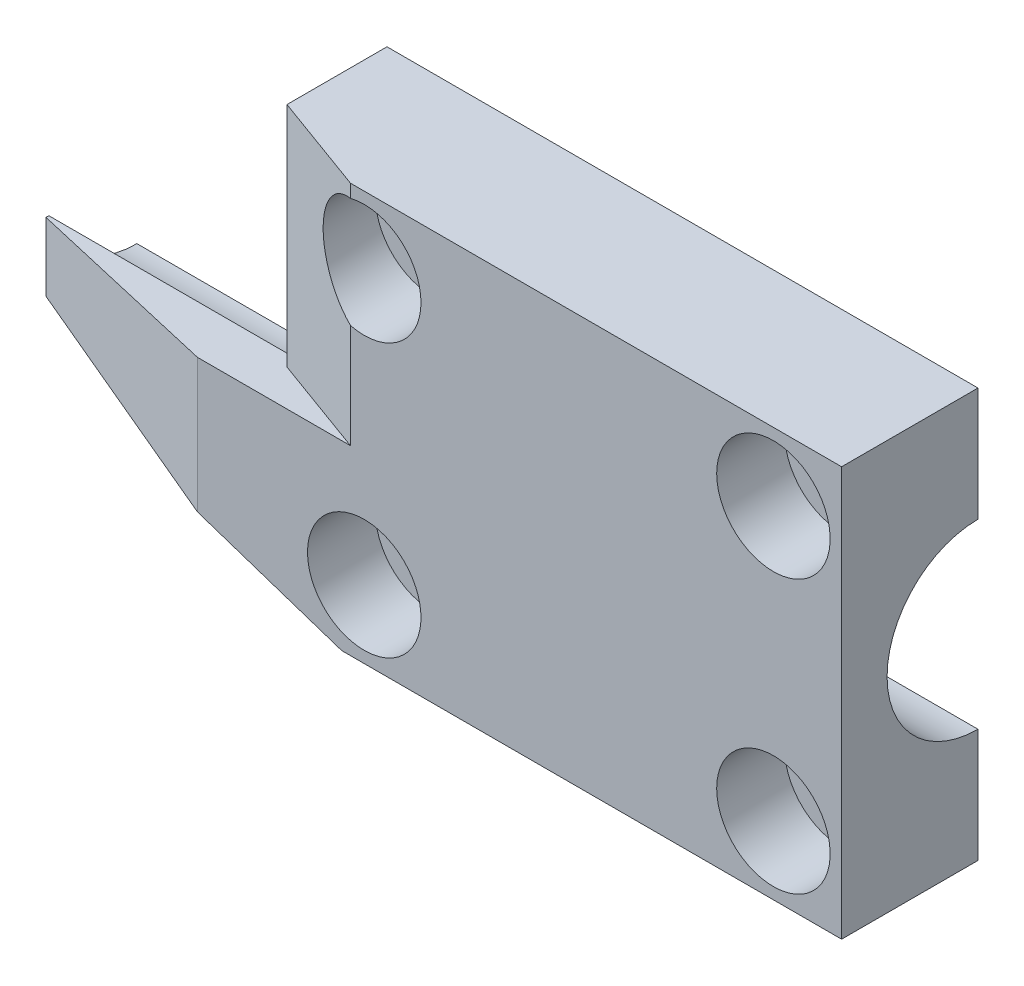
ISO-10303-21;
HEADER;
FILE_DESCRIPTION(('STEP AP214'),'2;1');
FILE_NAME('part.step','',(''),(''),'','','');
FILE_SCHEMA(('AUTOMOTIVE_DESIGN { 1 0 10303 214 1 1 1 1 }'));
ENDSEC;
DATA;
#1=APPLICATION_CONTEXT('core data for automotive mechanical design processes');
#2=APPLICATION_PROTOCOL_DEFINITION('international standard','automotive_design',2000,#1);
#3=PRODUCT_CONTEXT('',#1,'mechanical');
#4=PRODUCT('Part','Part','',(#3));
#5=PRODUCT_RELATED_PRODUCT_CATEGORY('part','',(#4));
#6=PRODUCT_DEFINITION_FORMATION('','',#4);
#7=PRODUCT_DEFINITION_CONTEXT('part definition',#1,'design');
#8=PRODUCT_DEFINITION('design','',#6,#7);
#9=PRODUCT_DEFINITION_SHAPE('','',#8);
#10=(LENGTH_UNIT() NAMED_UNIT(*) SI_UNIT(.MILLI.,.METRE.));
#11=(NAMED_UNIT(*) PLANE_ANGLE_UNIT() SI_UNIT($,.RADIAN.));
#12=(NAMED_UNIT(*) SI_UNIT($,.STERADIAN.) SOLID_ANGLE_UNIT());
#13=UNCERTAINTY_MEASURE_WITH_UNIT(LENGTH_MEASURE(1.E-05),#10,'distance_accuracy_value','');
#14=(GEOMETRIC_REPRESENTATION_CONTEXT(3) GLOBAL_UNCERTAINTY_ASSIGNED_CONTEXT((#13)) GLOBAL_UNIT_ASSIGNED_CONTEXT((#10,
#11,#12)) REPRESENTATION_CONTEXT('',''));
#15=CARTESIAN_POINT('',(0.,0.,0.));
#16=DIRECTION('',(0.,0.,1.));
#17=DIRECTION('',(1.,0.,0.));
#18=AXIS2_PLACEMENT_3D('',#15,#16,#17);
#19=CARTESIAN_POINT('',(0.,0.,9.525));
#20=DIRECTION('',(0.,0.,-1.));
#21=DIRECTION('',(-1.,0.,0.));
#22=AXIS2_PLACEMENT_3D('',#19,#20,#21);
#23=PLANE('',#22);
#24=CARTESIAN_POINT('',(14.2875,9.525,9.525));
#25=DIRECTION('',(0.,0.,-1.));
#26=DIRECTION('',(-1.,0.,0.));
#27=AXIS2_PLACEMENT_3D('',#24,#25,#26);
#28=CIRCLE('',#27,3.9624);
#29=CARTESIAN_POINT('',(10.3251,9.525,9.525));
#30=VERTEX_POINT('',#29);
#31=EDGE_CURVE('E199',#30,#30,#28,.F.);
#32=ORIENTED_EDGE('',*,*,#31,.F.);
#33=EDGE_LOOP('',(#32));
#34=FACE_BOUND('',#33,.T.);
#35=CARTESIAN_POINT('',(-14.2875,-9.525,9.525));
#36=DIRECTION('',(0.,0.,-1.));
#37=DIRECTION('',(-1.,0.,0.));
#38=AXIS2_PLACEMENT_3D('',#35,#36,#37);
#39=CIRCLE('',#38,3.9624);
#40=CARTESIAN_POINT('',(-18.2499,-9.525,9.525));
#41=VERTEX_POINT('',#40);
#42=EDGE_CURVE('E184',#41,#41,#39,.F.);
#43=ORIENTED_EDGE('',*,*,#42,.F.);
#44=EDGE_LOOP('',(#43));
#45=FACE_BOUND('',#44,.T.);
#46=DIRECTION('',(-1.,0.,0.));
#47=VECTOR('',#46,1.);
#48=CARTESIAN_POINT('',(-22.225,14.2875,9.525));
#49=LINE('',#48,#47);
#50=CARTESIAN_POINT('',(19.05,14.2875,9.525));
#51=VERTEX_POINT('',#50);
#52=CARTESIAN_POINT('',(-15.246407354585,14.2875,9.525));
#53=VERTEX_POINT('',#52);
#54=EDGE_CURVE('E151',#51,#53,#49,.T.);
#55=ORIENTED_EDGE('',*,*,#54,.T.);
#56=DIRECTION('',(0.,-1.,0.));
#57=VECTOR('',#56,1.);
#58=CARTESIAN_POINT('',(-15.246407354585,0.,9.525));
#59=LINE('',#58,#57);
#60=CARTESIAN_POINT('',(-15.246407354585,13.3696209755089,9.525));
#61=VERTEX_POINT('',#60);
#62=EDGE_CURVE('E219',#53,#61,#59,.T.);
#63=ORIENTED_EDGE('',*,*,#62,.T.);
#64=CARTESIAN_POINT('',(-14.2875,9.525,9.525));
#65=DIRECTION('',(0.,0.,-1.));
#66=DIRECTION('',(-1.,0.,0.));
#67=AXIS2_PLACEMENT_3D('',#64,#65,#66);
#68=CIRCLE('',#67,3.9624);
#69=CARTESIAN_POINT('',(-15.246407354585,5.68037902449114,9.525));
#70=VERTEX_POINT('',#69);
#71=EDGE_CURVE('E192',#70,#61,#68,.F.);
#72=ORIENTED_EDGE('',*,*,#71,.F.);
#73=DIRECTION('',(0.,-1.,0.));
#74=VECTOR('',#73,1.);
#75=CARTESIAN_POINT('',(-15.246407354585,0.,9.525));
#76=LINE('',#75,#74);
#77=CARTESIAN_POINT('',(-15.246407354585,-1.58750000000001,9.525));
#78=VERTEX_POINT('',#77);
#79=EDGE_CURVE('E216',#70,#78,#76,.T.);
#80=ORIENTED_EDGE('',*,*,#79,.T.);
#81=DIRECTION('',(-1.,0.,0.));
#82=VECTOR('',#81,1.);
#83=CARTESIAN_POINT('',(-39.6875,-1.58750000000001,9.525));
#84=LINE('',#83,#82);
#85=CARTESIAN_POINT('',(-25.935064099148,-1.58750000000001,9.52499999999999));
#86=VERTEX_POINT('',#85);
#87=EDGE_CURVE('E147',#78,#86,#84,.T.);
#88=ORIENTED_EDGE('',*,*,#87,.T.);
#89=DIRECTION('',(0.,-1.,0.));
#90=VECTOR('',#89,1.);
#91=CARTESIAN_POINT('',(-25.9350640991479,0.,9.525));
#92=LINE('',#91,#90);
#93=CARTESIAN_POINT('',(-25.9350640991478,-10.9370710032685,9.52500000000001));
#94=VERTEX_POINT('',#93);
#95=EDGE_CURVE('E130',#86,#94,#92,.T.);
#96=ORIENTED_EDGE('',*,*,#95,.T.);
#97=DIRECTION('',(0.948885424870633,-0.3156207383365,0.));
#98=VECTOR('',#97,1.);
#99=CARTESIAN_POINT('',(-5.85907965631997,-17.614797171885,9.525));
#100=LINE('',#99,#98);
#101=CARTESIAN_POINT('',(-15.8623,-14.2875,9.52500000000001));
#102=VERTEX_POINT('',#101);
#103=EDGE_CURVE('E120',#94,#102,#100,.T.);
#104=ORIENTED_EDGE('',*,*,#103,.T.);
#105=DIRECTION('',(1.,0.,0.));
#106=VECTOR('',#105,1.);
#107=CARTESIAN_POINT('',(19.05,-14.2875,9.525));
#108=LINE('',#107,#106);
#109=CARTESIAN_POINT('',(19.05,-14.2875,9.525));
#110=VERTEX_POINT('',#109);
#111=EDGE_CURVE('E126',#102,#110,#108,.T.);
#112=ORIENTED_EDGE('',*,*,#111,.T.);
#113=DIRECTION('',(0.,1.,0.));
#114=VECTOR('',#113,1.);
#115=CARTESIAN_POINT('',(19.05,14.2875,9.525));
#116=LINE('',#115,#114);
#117=EDGE_CURVE('E169',#110,#51,#116,.T.);
#118=ORIENTED_EDGE('',*,*,#117,.T.);
#119=EDGE_LOOP('',(#55,#63,#72,#80,#88,#96,#104,#112,#118));
#120=FACE_BOUND('',#119,.T.);
#121=CARTESIAN_POINT('',(14.2875,-9.525,9.525));
#122=DIRECTION('',(0.,0.,-1.));
#123=DIRECTION('',(-1.,0.,0.));
#124=AXIS2_PLACEMENT_3D('',#121,#122,#123);
#125=CIRCLE('',#124,3.96239999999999);
#126=CARTESIAN_POINT('',(10.3251,-9.525,9.525));
#127=VERTEX_POINT('',#126);
#128=EDGE_CURVE('E206',#127,#127,#125,.F.);
#129=ORIENTED_EDGE('',*,*,#128,.F.);
#130=EDGE_LOOP('',(#129));
#131=FACE_BOUND('',#130,.T.);
#132=ADVANCED_FACE('F33',(#34,#45,#120,#131),#23,.F.);
#133=CARTESIAN_POINT('',(14.2875,-9.525,9.525));
#134=DIRECTION('',(0.,0.,-1.));
#135=DIRECTION('',(-1.,0.,0.));
#136=AXIS2_PLACEMENT_3D('',#133,#134,#135);
#137=CYLINDRICAL_SURFACE('',#136,2.3876);
#138=CARTESIAN_POINT('',(14.2875,-9.525,0.));
#139=DIRECTION('',(0.,0.,1.));
#140=DIRECTION('',(1.,0.,0.));
#141=AXIS2_PLACEMENT_3D('',#138,#139,#140);
#142=CIRCLE('',#141,2.3876);
#143=CARTESIAN_POINT('',(11.8999,-9.525,0.));
#144=VERTEX_POINT('',#143);
#145=EDGE_CURVE('E273',#144,#144,#142,.T.);
#146=CARTESIAN_POINT('',(14.2875,-9.525,4.7752));
#147=DIRECTION('',(0.,0.,1.));
#148=DIRECTION('',(1.,0.,0.));
#149=AXIS2_PLACEMENT_3D('',#146,#147,#148);
#150=CIRCLE('',#149,2.3876);
#151=CARTESIAN_POINT('',(11.8999,-9.525,4.7752));
#152=VERTEX_POINT('',#151);
#153=EDGE_CURVE('E203',#152,#152,#150,.T.);
#154=CARTESIAN_POINT('',(11.8999,-9.525,0.));
#155=CARTESIAN_POINT('',(11.8999,-9.525,0.0497416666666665));
#156=CARTESIAN_POINT('',(11.8999,-9.525,0.0994833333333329));
#157=CARTESIAN_POINT('',(11.8999,-9.525,0.198966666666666));
#158=CARTESIAN_POINT('',(11.8999,-9.525,0.248708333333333));
#159=CARTESIAN_POINT('',(11.8999,-9.525,0.348191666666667));
#160=CARTESIAN_POINT('',(11.8999,-9.525,0.397933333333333));
#161=CARTESIAN_POINT('',(11.8999,-9.525,0.497416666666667));
#162=CARTESIAN_POINT('',(11.8999,-9.525,0.547158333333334));
#163=CARTESIAN_POINT('',(11.8999,-9.525,0.646641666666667));
#164=CARTESIAN_POINT('',(11.8999,-9.525,0.696383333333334));
#165=CARTESIAN_POINT('',(11.8999,-9.525,0.795866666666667));
#166=CARTESIAN_POINT('',(11.8999,-9.525,0.845608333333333));
#167=CARTESIAN_POINT('',(11.8999,-9.525,0.945091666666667));
#168=CARTESIAN_POINT('',(11.8999,-9.525,0.994833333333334));
#169=CARTESIAN_POINT('',(11.8999,-9.525,1.09431666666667));
#170=CARTESIAN_POINT('',(11.8999,-9.525,1.14405833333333));
#171=CARTESIAN_POINT('',(11.8999,-9.525,1.24354166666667));
#172=CARTESIAN_POINT('',(11.8999,-9.525,1.29328333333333));
#173=CARTESIAN_POINT('',(11.8999,-9.525,1.39276666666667));
#174=CARTESIAN_POINT('',(11.8999,-9.525,1.44250833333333));
#175=CARTESIAN_POINT('',(11.8999,-9.525,1.54199166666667));
#176=CARTESIAN_POINT('',(11.8999,-9.525,1.59173333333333));
#177=CARTESIAN_POINT('',(11.8999,-9.525,1.69121666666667));
#178=CARTESIAN_POINT('',(11.8999,-9.525,1.74095833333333));
#179=CARTESIAN_POINT('',(11.8999,-9.525,1.84044166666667));
#180=CARTESIAN_POINT('',(11.8999,-9.525,1.89018333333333));
#181=CARTESIAN_POINT('',(11.8999,-9.525,1.98966666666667));
#182=CARTESIAN_POINT('',(11.8999,-9.525,2.03940833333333));
#183=CARTESIAN_POINT('',(11.8999,-9.525,2.13889166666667));
#184=CARTESIAN_POINT('',(11.8999,-9.525,2.18863333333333));
#185=CARTESIAN_POINT('',(11.8999,-9.525,2.28811666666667));
#186=CARTESIAN_POINT('',(11.8999,-9.525,2.33785833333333));
#187=CARTESIAN_POINT('',(11.8999,-9.525,2.43734166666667));
#188=CARTESIAN_POINT('',(11.8999,-9.525,2.48708333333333));
#189=CARTESIAN_POINT('',(11.8999,-9.525,2.58656666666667));
#190=CARTESIAN_POINT('',(11.8999,-9.525,2.63630833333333));
#191=CARTESIAN_POINT('',(11.8999,-9.525,2.73579166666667));
#192=CARTESIAN_POINT('',(11.8999,-9.525,2.78553333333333));
#193=CARTESIAN_POINT('',(11.8999,-9.525,2.88501666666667));
#194=CARTESIAN_POINT('',(11.8999,-9.525,2.93475833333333));
#195=CARTESIAN_POINT('',(11.8999,-9.525,3.03424166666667));
#196=CARTESIAN_POINT('',(11.8999,-9.525,3.08398333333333));
#197=CARTESIAN_POINT('',(11.8999,-9.525,3.18346666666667));
#198=CARTESIAN_POINT('',(11.8999,-9.525,3.23320833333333));
#199=CARTESIAN_POINT('',(11.8999,-9.525,3.33269166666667));
#200=CARTESIAN_POINT('',(11.8999,-9.525,3.38243333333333));
#201=CARTESIAN_POINT('',(11.8999,-9.525,3.48191666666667));
#202=CARTESIAN_POINT('',(11.8999,-9.525,3.53165833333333));
#203=CARTESIAN_POINT('',(11.8999,-9.525,3.63114166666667));
#204=CARTESIAN_POINT('',(11.8999,-9.525,3.68088333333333));
#205=CARTESIAN_POINT('',(11.8999,-9.525,3.78036666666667));
#206=CARTESIAN_POINT('',(11.8999,-9.525,3.83010833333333));
#207=CARTESIAN_POINT('',(11.8999,-9.525,3.92959166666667));
#208=CARTESIAN_POINT('',(11.8999,-9.525,3.97933333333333));
#209=CARTESIAN_POINT('',(11.8999,-9.525,4.07881666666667));
#210=CARTESIAN_POINT('',(11.8999,-9.525,4.12855833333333));
#211=CARTESIAN_POINT('',(11.8999,-9.525,4.22804166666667));
#212=CARTESIAN_POINT('',(11.8999,-9.525,4.27778333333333));
#213=CARTESIAN_POINT('',(11.8999,-9.525,4.37726666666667));
#214=CARTESIAN_POINT('',(11.8999,-9.525,4.42700833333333));
#215=CARTESIAN_POINT('',(11.8999,-9.525,4.52649166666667));
#216=CARTESIAN_POINT('',(11.8999,-9.525,4.57623333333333));
#217=CARTESIAN_POINT('',(11.8999,-9.525,4.67571666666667));
#218=CARTESIAN_POINT('',(11.8999,-9.525,4.72545833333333));
#219=CARTESIAN_POINT('',(11.8999,-9.525,4.7752));
#220=B_SPLINE_CURVE_WITH_KNOTS('',3,(#154,#155,#156,#157,#158,#159,#160,#161,#162,#163,#164,
#165,#166,#167,#168,#169,#170,#171,#172,#173,#174,#175,#176,#177,#178,#179,#180,#181,#182,#183,
#184,#185,#186,#187,#188,#189,#190,#191,#192,#193,#194,#195,#196,#197,#198,#199,#200,#201,#202,
#203,#204,#205,#206,#207,#208,#209,#210,#211,#212,#213,#214,#215,#216,#217,#218,#219),
.UNSPECIFIED.,.F.,.F.,(4,2,2,2,2,2,2,2,2,2,2,2,2,2,2,2,2,2,2,2,2,2,2,2,2,2,2,2,2,2,2,2,4),(0.,
0.149224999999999,0.29845,0.447675,0.596900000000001,0.746125,0.89535,1.044575,1.1938,1.343025,
1.49225,1.641475,1.7907,1.939925,2.08915,2.238375,2.3876,2.536825,2.68605,2.835275,2.9845,
3.133725,3.28295,3.432175,3.5814,3.730625,3.87985,4.029075,4.1783,4.327525,4.47675,4.625975,
4.7752),.UNSPECIFIED.);
#221=EDGE_CURVE('BSEAM305',#144,#152,#220,.T.);
#222=ORIENTED_EDGE('',*,*,#145,.F.);
#223=ORIENTED_EDGE('',*,*,#153,.T.);
#224=ORIENTED_EDGE('',*,*,#221,.T.);
#225=ORIENTED_EDGE('',*,*,#221,.F.);
#226=EDGE_LOOP('',(#222,#224,#223,#225));
#227=FACE_BOUND('',#226,.T.);
#228=ADVANCED_FACE('F305',(#227),#137,.F.);
#229=CARTESIAN_POINT('',(14.2875,9.525,9.525));
#230=DIRECTION('',(0.,0.,-1.));
#231=DIRECTION('',(-1.,0.,0.));
#232=AXIS2_PLACEMENT_3D('',#229,#230,#231);
#233=CYLINDRICAL_SURFACE('',#232,2.3876);
#234=CARTESIAN_POINT('',(14.2875,9.525,0.));
#235=DIRECTION('',(0.,0.,1.));
#236=DIRECTION('',(1.,0.,0.));
#237=AXIS2_PLACEMENT_3D('',#234,#235,#236);
#238=CIRCLE('',#237,2.3876);
#239=CARTESIAN_POINT('',(11.8999,9.525,0.));
#240=VERTEX_POINT('',#239);
#241=EDGE_CURVE('E270',#240,#240,#238,.T.);
#242=CARTESIAN_POINT('',(14.2875,9.525,4.7752));
#243=DIRECTION('',(0.,0.,1.));
#244=DIRECTION('',(1.,0.,0.));
#245=AXIS2_PLACEMENT_3D('',#242,#243,#244);
#246=CIRCLE('',#245,2.3876);
#247=CARTESIAN_POINT('',(11.8999,9.525,4.7752));
#248=VERTEX_POINT('',#247);
#249=EDGE_CURVE('E196',#248,#248,#246,.T.);
#250=CARTESIAN_POINT('',(11.8999,9.525,0.));
#251=CARTESIAN_POINT('',(11.8999,9.525,0.0497416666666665));
#252=CARTESIAN_POINT('',(11.8999,9.525,0.0994833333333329));
#253=CARTESIAN_POINT('',(11.8999,9.525,0.198966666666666));
#254=CARTESIAN_POINT('',(11.8999,9.525,0.248708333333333));
#255=CARTESIAN_POINT('',(11.8999,9.525,0.348191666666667));
#256=CARTESIAN_POINT('',(11.8999,9.525,0.397933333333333));
#257=CARTESIAN_POINT('',(11.8999,9.525,0.497416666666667));
#258=CARTESIAN_POINT('',(11.8999,9.525,0.547158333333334));
#259=CARTESIAN_POINT('',(11.8999,9.525,0.646641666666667));
#260=CARTESIAN_POINT('',(11.8999,9.525,0.696383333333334));
#261=CARTESIAN_POINT('',(11.8999,9.525,0.795866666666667));
#262=CARTESIAN_POINT('',(11.8999,9.525,0.845608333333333));
#263=CARTESIAN_POINT('',(11.8999,9.525,0.945091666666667));
#264=CARTESIAN_POINT('',(11.8999,9.525,0.994833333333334));
#265=CARTESIAN_POINT('',(11.8999,9.525,1.09431666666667));
#266=CARTESIAN_POINT('',(11.8999,9.525,1.14405833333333));
#267=CARTESIAN_POINT('',(11.8999,9.525,1.24354166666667));
#268=CARTESIAN_POINT('',(11.8999,9.525,1.29328333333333));
#269=CARTESIAN_POINT('',(11.8999,9.525,1.39276666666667));
#270=CARTESIAN_POINT('',(11.8999,9.525,1.44250833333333));
#271=CARTESIAN_POINT('',(11.8999,9.525,1.54199166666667));
#272=CARTESIAN_POINT('',(11.8999,9.525,1.59173333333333));
#273=CARTESIAN_POINT('',(11.8999,9.525,1.69121666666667));
#274=CARTESIAN_POINT('',(11.8999,9.525,1.74095833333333));
#275=CARTESIAN_POINT('',(11.8999,9.525,1.84044166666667));
#276=CARTESIAN_POINT('',(11.8999,9.525,1.89018333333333));
#277=CARTESIAN_POINT('',(11.8999,9.525,1.98966666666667));
#278=CARTESIAN_POINT('',(11.8999,9.525,2.03940833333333));
#279=CARTESIAN_POINT('',(11.8999,9.525,2.13889166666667));
#280=CARTESIAN_POINT('',(11.8999,9.525,2.18863333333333));
#281=CARTESIAN_POINT('',(11.8999,9.525,2.28811666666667));
#282=CARTESIAN_POINT('',(11.8999,9.525,2.33785833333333));
#283=CARTESIAN_POINT('',(11.8999,9.525,2.43734166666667));
#284=CARTESIAN_POINT('',(11.8999,9.525,2.48708333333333));
#285=CARTESIAN_POINT('',(11.8999,9.525,2.58656666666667));
#286=CARTESIAN_POINT('',(11.8999,9.525,2.63630833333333));
#287=CARTESIAN_POINT('',(11.8999,9.525,2.73579166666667));
#288=CARTESIAN_POINT('',(11.8999,9.525,2.78553333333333));
#289=CARTESIAN_POINT('',(11.8999,9.525,2.88501666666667));
#290=CARTESIAN_POINT('',(11.8999,9.525,2.93475833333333));
#291=CARTESIAN_POINT('',(11.8999,9.525,3.03424166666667));
#292=CARTESIAN_POINT('',(11.8999,9.525,3.08398333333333));
#293=CARTESIAN_POINT('',(11.8999,9.525,3.18346666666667));
#294=CARTESIAN_POINT('',(11.8999,9.525,3.23320833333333));
#295=CARTESIAN_POINT('',(11.8999,9.525,3.33269166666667));
#296=CARTESIAN_POINT('',(11.8999,9.525,3.38243333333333));
#297=CARTESIAN_POINT('',(11.8999,9.525,3.48191666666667));
#298=CARTESIAN_POINT('',(11.8999,9.525,3.53165833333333));
#299=CARTESIAN_POINT('',(11.8999,9.525,3.63114166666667));
#300=CARTESIAN_POINT('',(11.8999,9.525,3.68088333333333));
#301=CARTESIAN_POINT('',(11.8999,9.525,3.78036666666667));
#302=CARTESIAN_POINT('',(11.8999,9.525,3.83010833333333));
#303=CARTESIAN_POINT('',(11.8999,9.525,3.92959166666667));
#304=CARTESIAN_POINT('',(11.8999,9.525,3.97933333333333));
#305=CARTESIAN_POINT('',(11.8999,9.525,4.07881666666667));
#306=CARTESIAN_POINT('',(11.8999,9.525,4.12855833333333));
#307=CARTESIAN_POINT('',(11.8999,9.525,4.22804166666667));
#308=CARTESIAN_POINT('',(11.8999,9.525,4.27778333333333));
#309=CARTESIAN_POINT('',(11.8999,9.525,4.37726666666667));
#310=CARTESIAN_POINT('',(11.8999,9.525,4.42700833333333));
#311=CARTESIAN_POINT('',(11.8999,9.525,4.52649166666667));
#312=CARTESIAN_POINT('',(11.8999,9.525,4.57623333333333));
#313=CARTESIAN_POINT('',(11.8999,9.525,4.67571666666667));
#314=CARTESIAN_POINT('',(11.8999,9.525,4.72545833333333));
#315=CARTESIAN_POINT('',(11.8999,9.525,4.7752));
#316=B_SPLINE_CURVE_WITH_KNOTS('',3,(#250,#251,#252,#253,#254,#255,#256,#257,#258,#259,#260,
#261,#262,#263,#264,#265,#266,#267,#268,#269,#270,#271,#272,#273,#274,#275,#276,#277,#278,#279,
#280,#281,#282,#283,#284,#285,#286,#287,#288,#289,#290,#291,#292,#293,#294,#295,#296,#297,#298,
#299,#300,#301,#302,#303,#304,#305,#306,#307,#308,#309,#310,#311,#312,#313,#314,#315),
.UNSPECIFIED.,.F.,.F.,(4,2,2,2,2,2,2,2,2,2,2,2,2,2,2,2,2,2,2,2,2,2,2,2,2,2,2,2,2,2,2,2,4),(0.,
0.149224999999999,0.29845,0.447675,0.596900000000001,0.746125,0.89535,1.044575,1.1938,1.343025,
1.49225,1.641475,1.7907,1.939925,2.08915,2.238375,2.3876,2.536825,2.68605,2.835275,2.9845,
3.133725,3.28295,3.432175,3.5814,3.730625,3.87985,4.029075,4.1783,4.327525,4.47675,4.625975,
4.7752),.UNSPECIFIED.);
#317=EDGE_CURVE('BSEAM308',#240,#248,#316,.T.);
#318=ORIENTED_EDGE('',*,*,#241,.F.);
#319=ORIENTED_EDGE('',*,*,#249,.T.);
#320=ORIENTED_EDGE('',*,*,#317,.T.);
#321=ORIENTED_EDGE('',*,*,#317,.F.);
#322=EDGE_LOOP('',(#318,#320,#319,#321));
#323=FACE_BOUND('',#322,.T.);
#324=ADVANCED_FACE('F308',(#323),#233,.F.);
#325=CARTESIAN_POINT('',(-14.2875,9.525,9.525));
#326=DIRECTION('',(0.,0.,-1.));
#327=DIRECTION('',(-1.,0.,0.));
#328=AXIS2_PLACEMENT_3D('',#325,#326,#327);
#329=CYLINDRICAL_SURFACE('',#328,2.3876);
#330=CARTESIAN_POINT('',(-14.2875,9.525,0.));
#331=DIRECTION('',(0.,0.,1.));
#332=DIRECTION('',(1.,0.,0.));
#333=AXIS2_PLACEMENT_3D('',#330,#331,#332);
#334=CIRCLE('',#333,2.3876);
#335=CARTESIAN_POINT('',(-16.6751,9.525,0.));
#336=VERTEX_POINT('',#335);
#337=EDGE_CURVE('E267',#336,#336,#334,.T.);
#338=CARTESIAN_POINT('',(-14.2875,9.525,4.7752));
#339=DIRECTION('',(0.,0.,1.));
#340=DIRECTION('',(1.,0.,0.));
#341=AXIS2_PLACEMENT_3D('',#338,#339,#340);
#342=CIRCLE('',#341,2.3876);
#343=CARTESIAN_POINT('',(-16.6751,9.525,4.7752));
#344=VERTEX_POINT('',#343);
#345=EDGE_CURVE('E189',#344,#344,#342,.T.);
#346=CARTESIAN_POINT('',(-16.6751,9.525,0.));
#347=CARTESIAN_POINT('',(-16.6751,9.525,0.0497416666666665));
#348=CARTESIAN_POINT('',(-16.6751,9.525,0.0994833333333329));
#349=CARTESIAN_POINT('',(-16.6751,9.525,0.198966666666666));
#350=CARTESIAN_POINT('',(-16.6751,9.525,0.248708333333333));
#351=CARTESIAN_POINT('',(-16.6751,9.525,0.348191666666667));
#352=CARTESIAN_POINT('',(-16.6751,9.525,0.397933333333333));
#353=CARTESIAN_POINT('',(-16.6751,9.525,0.497416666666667));
#354=CARTESIAN_POINT('',(-16.6751,9.525,0.547158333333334));
#355=CARTESIAN_POINT('',(-16.6751,9.525,0.646641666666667));
#356=CARTESIAN_POINT('',(-16.6751,9.525,0.696383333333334));
#357=CARTESIAN_POINT('',(-16.6751,9.525,0.795866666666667));
#358=CARTESIAN_POINT('',(-16.6751,9.525,0.845608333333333));
#359=CARTESIAN_POINT('',(-16.6751,9.525,0.945091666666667));
#360=CARTESIAN_POINT('',(-16.6751,9.525,0.994833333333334));
#361=CARTESIAN_POINT('',(-16.6751,9.525,1.09431666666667));
#362=CARTESIAN_POINT('',(-16.6751,9.525,1.14405833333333));
#363=CARTESIAN_POINT('',(-16.6751,9.525,1.24354166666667));
#364=CARTESIAN_POINT('',(-16.6751,9.525,1.29328333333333));
#365=CARTESIAN_POINT('',(-16.6751,9.525,1.39276666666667));
#366=CARTESIAN_POINT('',(-16.6751,9.525,1.44250833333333));
#367=CARTESIAN_POINT('',(-16.6751,9.525,1.54199166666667));
#368=CARTESIAN_POINT('',(-16.6751,9.525,1.59173333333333));
#369=CARTESIAN_POINT('',(-16.6751,9.525,1.69121666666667));
#370=CARTESIAN_POINT('',(-16.6751,9.525,1.74095833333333));
#371=CARTESIAN_POINT('',(-16.6751,9.525,1.84044166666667));
#372=CARTESIAN_POINT('',(-16.6751,9.525,1.89018333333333));
#373=CARTESIAN_POINT('',(-16.6751,9.525,1.98966666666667));
#374=CARTESIAN_POINT('',(-16.6751,9.525,2.03940833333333));
#375=CARTESIAN_POINT('',(-16.6751,9.525,2.13889166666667));
#376=CARTESIAN_POINT('',(-16.6751,9.525,2.18863333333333));
#377=CARTESIAN_POINT('',(-16.6751,9.525,2.28811666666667));
#378=CARTESIAN_POINT('',(-16.6751,9.525,2.33785833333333));
#379=CARTESIAN_POINT('',(-16.6751,9.525,2.43734166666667));
#380=CARTESIAN_POINT('',(-16.6751,9.525,2.48708333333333));
#381=CARTESIAN_POINT('',(-16.6751,9.525,2.58656666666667));
#382=CARTESIAN_POINT('',(-16.6751,9.525,2.63630833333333));
#383=CARTESIAN_POINT('',(-16.6751,9.525,2.73579166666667));
#384=CARTESIAN_POINT('',(-16.6751,9.525,2.78553333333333));
#385=CARTESIAN_POINT('',(-16.6751,9.525,2.88501666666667));
#386=CARTESIAN_POINT('',(-16.6751,9.525,2.93475833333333));
#387=CARTESIAN_POINT('',(-16.6751,9.525,3.03424166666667));
#388=CARTESIAN_POINT('',(-16.6751,9.525,3.08398333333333));
#389=CARTESIAN_POINT('',(-16.6751,9.525,3.18346666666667));
#390=CARTESIAN_POINT('',(-16.6751,9.525,3.23320833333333));
#391=CARTESIAN_POINT('',(-16.6751,9.525,3.33269166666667));
#392=CARTESIAN_POINT('',(-16.6751,9.525,3.38243333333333));
#393=CARTESIAN_POINT('',(-16.6751,9.525,3.48191666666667));
#394=CARTESIAN_POINT('',(-16.6751,9.525,3.53165833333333));
#395=CARTESIAN_POINT('',(-16.6751,9.525,3.63114166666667));
#396=CARTESIAN_POINT('',(-16.6751,9.525,3.68088333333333));
#397=CARTESIAN_POINT('',(-16.6751,9.525,3.78036666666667));
#398=CARTESIAN_POINT('',(-16.6751,9.525,3.83010833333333));
#399=CARTESIAN_POINT('',(-16.6751,9.525,3.92959166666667));
#400=CARTESIAN_POINT('',(-16.6751,9.525,3.97933333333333));
#401=CARTESIAN_POINT('',(-16.6751,9.525,4.07881666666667));
#402=CARTESIAN_POINT('',(-16.6751,9.525,4.12855833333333));
#403=CARTESIAN_POINT('',(-16.6751,9.525,4.22804166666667));
#404=CARTESIAN_POINT('',(-16.6751,9.525,4.27778333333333));
#405=CARTESIAN_POINT('',(-16.6751,9.525,4.37726666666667));
#406=CARTESIAN_POINT('',(-16.6751,9.525,4.42700833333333));
#407=CARTESIAN_POINT('',(-16.6751,9.525,4.52649166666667));
#408=CARTESIAN_POINT('',(-16.6751,9.525,4.57623333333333));
#409=CARTESIAN_POINT('',(-16.6751,9.525,4.67571666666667));
#410=CARTESIAN_POINT('',(-16.6751,9.525,4.72545833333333));
#411=CARTESIAN_POINT('',(-16.6751,9.525,4.7752));
#412=B_SPLINE_CURVE_WITH_KNOTS('',3,(#346,#347,#348,#349,#350,#351,#352,#353,#354,#355,#356,
#357,#358,#359,#360,#361,#362,#363,#364,#365,#366,#367,#368,#369,#370,#371,#372,#373,#374,#375,
#376,#377,#378,#379,#380,#381,#382,#383,#384,#385,#386,#387,#388,#389,#390,#391,#392,#393,#394,
#395,#396,#397,#398,#399,#400,#401,#402,#403,#404,#405,#406,#407,#408,#409,#410,#411),
.UNSPECIFIED.,.F.,.F.,(4,2,2,2,2,2,2,2,2,2,2,2,2,2,2,2,2,2,2,2,2,2,2,2,2,2,2,2,2,2,2,2,4),(0.,
0.149224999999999,0.29845,0.447675,0.596900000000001,0.746125,0.89535,1.044575,1.1938,1.343025,
1.49225,1.641475,1.7907,1.939925,2.08915,2.238375,2.3876,2.536825,2.68605,2.835275,2.9845,
3.133725,3.28295,3.432175,3.5814,3.730625,3.87985,4.029075,4.1783,4.327525,4.47675,4.625975,
4.7752),.UNSPECIFIED.);
#413=EDGE_CURVE('BSEAM378',#336,#344,#412,.T.);
#414=ORIENTED_EDGE('',*,*,#337,.F.);
#415=ORIENTED_EDGE('',*,*,#345,.T.);
#416=ORIENTED_EDGE('',*,*,#413,.T.);
#417=ORIENTED_EDGE('',*,*,#413,.F.);
#418=EDGE_LOOP('',(#414,#416,#415,#417));
#419=FACE_BOUND('',#418,.T.);
#420=ADVANCED_FACE('F378',(#419),#329,.F.);
#421=CARTESIAN_POINT('',(-14.2875,-9.525,9.525));
#422=DIRECTION('',(0.,0.,-1.));
#423=DIRECTION('',(-1.,0.,0.));
#424=AXIS2_PLACEMENT_3D('',#421,#422,#423);
#425=CYLINDRICAL_SURFACE('',#424,2.3876);
#426=CARTESIAN_POINT('',(-14.2875,-9.525,0.));
#427=DIRECTION('',(0.,0.,1.));
#428=DIRECTION('',(1.,0.,0.));
#429=AXIS2_PLACEMENT_3D('',#426,#427,#428);
#430=CIRCLE('',#429,2.3876);
#431=CARTESIAN_POINT('',(-16.6751,-9.525,0.));
#432=VERTEX_POINT('',#431);
#433=EDGE_CURVE('E276',#432,#432,#430,.T.);
#434=CARTESIAN_POINT('',(-14.2875,-9.525,4.7752));
#435=DIRECTION('',(0.,0.,1.));
#436=DIRECTION('',(1.,0.,0.));
#437=AXIS2_PLACEMENT_3D('',#434,#435,#436);
#438=CIRCLE('',#437,2.3876);
#439=CARTESIAN_POINT('',(-16.6751,-9.525,4.7752));
#440=VERTEX_POINT('',#439);
#441=EDGE_CURVE('E181',#440,#440,#438,.T.);
#442=CARTESIAN_POINT('',(-16.6751,-9.525,0.));
#443=CARTESIAN_POINT('',(-16.6751,-9.525,0.0497416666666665));
#444=CARTESIAN_POINT('',(-16.6751,-9.525,0.0994833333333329));
#445=CARTESIAN_POINT('',(-16.6751,-9.525,0.198966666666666));
#446=CARTESIAN_POINT('',(-16.6751,-9.525,0.248708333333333));
#447=CARTESIAN_POINT('',(-16.6751,-9.525,0.348191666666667));
#448=CARTESIAN_POINT('',(-16.6751,-9.525,0.397933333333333));
#449=CARTESIAN_POINT('',(-16.6751,-9.525,0.497416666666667));
#450=CARTESIAN_POINT('',(-16.6751,-9.525,0.547158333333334));
#451=CARTESIAN_POINT('',(-16.6751,-9.525,0.646641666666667));
#452=CARTESIAN_POINT('',(-16.6751,-9.525,0.696383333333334));
#453=CARTESIAN_POINT('',(-16.6751,-9.525,0.795866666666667));
#454=CARTESIAN_POINT('',(-16.6751,-9.525,0.845608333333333));
#455=CARTESIAN_POINT('',(-16.6751,-9.525,0.945091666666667));
#456=CARTESIAN_POINT('',(-16.6751,-9.525,0.994833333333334));
#457=CARTESIAN_POINT('',(-16.6751,-9.525,1.09431666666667));
#458=CARTESIAN_POINT('',(-16.6751,-9.525,1.14405833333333));
#459=CARTESIAN_POINT('',(-16.6751,-9.525,1.24354166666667));
#460=CARTESIAN_POINT('',(-16.6751,-9.525,1.29328333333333));
#461=CARTESIAN_POINT('',(-16.6751,-9.525,1.39276666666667));
#462=CARTESIAN_POINT('',(-16.6751,-9.525,1.44250833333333));
#463=CARTESIAN_POINT('',(-16.6751,-9.525,1.54199166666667));
#464=CARTESIAN_POINT('',(-16.6751,-9.525,1.59173333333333));
#465=CARTESIAN_POINT('',(-16.6751,-9.525,1.69121666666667));
#466=CARTESIAN_POINT('',(-16.6751,-9.525,1.74095833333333));
#467=CARTESIAN_POINT('',(-16.6751,-9.525,1.84044166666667));
#468=CARTESIAN_POINT('',(-16.6751,-9.525,1.89018333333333));
#469=CARTESIAN_POINT('',(-16.6751,-9.525,1.98966666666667));
#470=CARTESIAN_POINT('',(-16.6751,-9.525,2.03940833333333));
#471=CARTESIAN_POINT('',(-16.6751,-9.525,2.13889166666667));
#472=CARTESIAN_POINT('',(-16.6751,-9.525,2.18863333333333));
#473=CARTESIAN_POINT('',(-16.6751,-9.525,2.28811666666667));
#474=CARTESIAN_POINT('',(-16.6751,-9.525,2.33785833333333));
#475=CARTESIAN_POINT('',(-16.6751,-9.525,2.43734166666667));
#476=CARTESIAN_POINT('',(-16.6751,-9.525,2.48708333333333));
#477=CARTESIAN_POINT('',(-16.6751,-9.525,2.58656666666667));
#478=CARTESIAN_POINT('',(-16.6751,-9.525,2.63630833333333));
#479=CARTESIAN_POINT('',(-16.6751,-9.525,2.73579166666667));
#480=CARTESIAN_POINT('',(-16.6751,-9.525,2.78553333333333));
#481=CARTESIAN_POINT('',(-16.6751,-9.525,2.88501666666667));
#482=CARTESIAN_POINT('',(-16.6751,-9.525,2.93475833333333));
#483=CARTESIAN_POINT('',(-16.6751,-9.525,3.03424166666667));
#484=CARTESIAN_POINT('',(-16.6751,-9.525,3.08398333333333));
#485=CARTESIAN_POINT('',(-16.6751,-9.525,3.18346666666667));
#486=CARTESIAN_POINT('',(-16.6751,-9.525,3.23320833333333));
#487=CARTESIAN_POINT('',(-16.6751,-9.525,3.33269166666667));
#488=CARTESIAN_POINT('',(-16.6751,-9.525,3.38243333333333));
#489=CARTESIAN_POINT('',(-16.6751,-9.525,3.48191666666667));
#490=CARTESIAN_POINT('',(-16.6751,-9.525,3.53165833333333));
#491=CARTESIAN_POINT('',(-16.6751,-9.525,3.63114166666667));
#492=CARTESIAN_POINT('',(-16.6751,-9.525,3.68088333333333));
#493=CARTESIAN_POINT('',(-16.6751,-9.525,3.78036666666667));
#494=CARTESIAN_POINT('',(-16.6751,-9.525,3.83010833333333));
#495=CARTESIAN_POINT('',(-16.6751,-9.525,3.92959166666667));
#496=CARTESIAN_POINT('',(-16.6751,-9.525,3.97933333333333));
#497=CARTESIAN_POINT('',(-16.6751,-9.525,4.07881666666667));
#498=CARTESIAN_POINT('',(-16.6751,-9.525,4.12855833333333));
#499=CARTESIAN_POINT('',(-16.6751,-9.525,4.22804166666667));
#500=CARTESIAN_POINT('',(-16.6751,-9.525,4.27778333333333));
#501=CARTESIAN_POINT('',(-16.6751,-9.525,4.37726666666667));
#502=CARTESIAN_POINT('',(-16.6751,-9.525,4.42700833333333));
#503=CARTESIAN_POINT('',(-16.6751,-9.525,4.52649166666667));
#504=CARTESIAN_POINT('',(-16.6751,-9.525,4.57623333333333));
#505=CARTESIAN_POINT('',(-16.6751,-9.525,4.67571666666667));
#506=CARTESIAN_POINT('',(-16.6751,-9.525,4.72545833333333));
#507=CARTESIAN_POINT('',(-16.6751,-9.525,4.7752));
#508=B_SPLINE_CURVE_WITH_KNOTS('',3,(#442,#443,#444,#445,#446,#447,#448,#449,#450,#451,#452,
#453,#454,#455,#456,#457,#458,#459,#460,#461,#462,#463,#464,#465,#466,#467,#468,#469,#470,#471,
#472,#473,#474,#475,#476,#477,#478,#479,#480,#481,#482,#483,#484,#485,#486,#487,#488,#489,#490,
#491,#492,#493,#494,#495,#496,#497,#498,#499,#500,#501,#502,#503,#504,#505,#506,#507),
.UNSPECIFIED.,.F.,.F.,(4,2,2,2,2,2,2,2,2,2,2,2,2,2,2,2,2,2,2,2,2,2,2,2,2,2,2,2,2,2,2,2,4),(0.,
0.149224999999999,0.29845,0.447675,0.596900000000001,0.746125,0.89535,1.044575,1.1938,1.343025,
1.49225,1.641475,1.7907,1.939925,2.08915,2.238375,2.3876,2.536825,2.68605,2.835275,2.9845,
3.133725,3.28295,3.432175,3.5814,3.730625,3.87985,4.029075,4.1783,4.327525,4.47675,4.625975,
4.7752),.UNSPECIFIED.);
#509=EDGE_CURVE('BSEAM332',#432,#440,#508,.T.);
#510=ORIENTED_EDGE('',*,*,#433,.F.);
#511=ORIENTED_EDGE('',*,*,#441,.T.);
#512=ORIENTED_EDGE('',*,*,#509,.T.);
#513=ORIENTED_EDGE('',*,*,#509,.F.);
#514=EDGE_LOOP('',(#510,#512,#511,#513));
#515=FACE_BOUND('',#514,.T.);
#516=ADVANCED_FACE('F332',(#515),#425,.F.);
#517=CARTESIAN_POINT('',(0.,0.,0.));
#518=DIRECTION('',(0.,0.,-1.));
#519=DIRECTION('',(-1.,0.,0.));
#520=AXIS2_PLACEMENT_3D('',#517,#518,#519);
#521=PLANE('',#520);
#522=DIRECTION('',(1.,0.,0.));
#523=VECTOR('',#522,1.);
#524=CARTESIAN_POINT('',(-53.0225,6.35,0.));
#525=LINE('',#524,#523);
#526=CARTESIAN_POINT('',(-22.225,6.35,0.));
#527=VERTEX_POINT('',#526);
#528=CARTESIAN_POINT('',(19.05,6.35,0.));
#529=VERTEX_POINT('',#528);
#530=EDGE_CURVE('E262',#527,#529,#525,.T.);
#531=ORIENTED_EDGE('',*,*,#530,.F.);
#532=DIRECTION('',(0.,-1.,0.));
#533=VECTOR('',#532,1.);
#534=CARTESIAN_POINT('',(-22.225,-1.58750000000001,0.));
#535=LINE('',#534,#533);
#536=CARTESIAN_POINT('',(-22.225,14.2875,0.));
#537=VERTEX_POINT('',#536);
#538=EDGE_CURVE('E162',#537,#527,#535,.T.);
#539=ORIENTED_EDGE('',*,*,#538,.F.);
#540=DIRECTION('',(-1.,0.,0.));
#541=VECTOR('',#540,1.);
#542=CARTESIAN_POINT('',(-22.225,14.2875,0.));
#543=LINE('',#542,#541);
#544=CARTESIAN_POINT('',(19.05,14.2875,0.));
#545=VERTEX_POINT('',#544);
#546=EDGE_CURVE('E158',#545,#537,#543,.T.);
#547=ORIENTED_EDGE('',*,*,#546,.F.);
#548=DIRECTION('',(0.,1.,0.));
#549=VECTOR('',#548,1.);
#550=CARTESIAN_POINT('',(19.05,14.2875,0.));
#551=LINE('',#550,#549);
#552=EDGE_CURVE('E159',#529,#545,#551,.T.);
#553=ORIENTED_EDGE('',*,*,#552,.F.);
#554=EDGE_LOOP('',(#531,#539,#547,#553));
#555=FACE_BOUND('',#554,.T.);
#556=ORIENTED_EDGE('',*,*,#337,.T.);
#557=EDGE_LOOP('',(#556));
#558=FACE_BOUND('',#557,.T.);
#559=ORIENTED_EDGE('',*,*,#241,.T.);
#560=EDGE_LOOP('',(#559));
#561=FACE_BOUND('',#560,.T.);
#562=ADVANCED_FACE('F288',(#555,#558,#561),#521,.T.);
#563=DIRECTION('',(0.948885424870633,-0.3156207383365,0.));
#564=VECTOR('',#563,1.);
#565=CARTESIAN_POINT('',(-5.85907965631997,-17.614797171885,0.));
#566=LINE('',#565,#564);
#567=CARTESIAN_POINT('',(-39.6875,-6.36270000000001,0.));
#568=VERTEX_POINT('',#567);
#569=CARTESIAN_POINT('',(-15.8623,-14.2875,0.));
#570=VERTEX_POINT('',#569);
#571=EDGE_CURVE('E133',#568,#570,#566,.T.);
#572=ORIENTED_EDGE('',*,*,#571,.F.);
#573=DIRECTION('',(0.,-1.,0.));
#574=VECTOR('',#573,1.);
#575=CARTESIAN_POINT('',(-39.6875,-14.2875,0.));
#576=LINE('',#575,#574);
#577=CARTESIAN_POINT('',(-39.6875,-6.35,0.));
#578=VERTEX_POINT('',#577);
#579=EDGE_CURVE('E165',#578,#568,#576,.T.);
#580=ORIENTED_EDGE('',*,*,#579,.F.);
#581=DIRECTION('',(1.,0.,0.));
#582=VECTOR('',#581,1.);
#583=CARTESIAN_POINT('',(-53.0225,-6.35,0.));
#584=LINE('',#583,#582);
#585=CARTESIAN_POINT('',(19.05,-6.35,0.));
#586=VERTEX_POINT('',#585);
#587=EDGE_CURVE('E260',#586,#578,#584,.F.);
#588=ORIENTED_EDGE('',*,*,#587,.F.);
#589=CARTESIAN_POINT('',(19.05,-14.2875,0.));
#590=VERTEX_POINT('',#589);
#591=EDGE_CURVE('E155',#590,#586,#551,.T.);
#592=ORIENTED_EDGE('',*,*,#591,.F.);
#593=DIRECTION('',(1.,0.,0.));
#594=VECTOR('',#593,1.);
#595=CARTESIAN_POINT('',(19.05,-14.2875,0.));
#596=LINE('',#595,#594);
#597=EDGE_CURVE('E168',#570,#590,#596,.T.);
#598=ORIENTED_EDGE('',*,*,#597,.F.);
#599=EDGE_LOOP('',(#572,#580,#588,#592,#598));
#600=FACE_BOUND('',#599,.T.);
#601=ORIENTED_EDGE('',*,*,#433,.T.);
#602=EDGE_LOOP('',(#601));
#603=FACE_BOUND('',#602,.T.);
#604=ORIENTED_EDGE('',*,*,#145,.T.);
#605=EDGE_LOOP('',(#604));
#606=FACE_BOUND('',#605,.T.);
#607=ADVANCED_FACE('F298',(#600,#603,#606),#521,.T.);
#608=CARTESIAN_POINT('',(19.05,14.2875,9.525));
#609=DIRECTION('',(-1.,0.,0.));
#610=DIRECTION('',(0.,-1.,0.));
#611=AXIS2_PLACEMENT_3D('',#608,#609,#610);
#612=PLANE('',#611);
#613=ORIENTED_EDGE('',*,*,#591,.T.);
#614=CARTESIAN_POINT('',(19.05,0.,0.));
#615=DIRECTION('',(-1.,0.,0.));
#616=DIRECTION('',(0.,-1.,0.));
#617=AXIS2_PLACEMENT_3D('',#614,#615,#616);
#618=CIRCLE('',#617,6.35);
#619=EDGE_CURVE('E264',#586,#529,#618,.T.);
#620=ORIENTED_EDGE('',*,*,#619,.T.);
#621=ORIENTED_EDGE('',*,*,#552,.T.);
#622=DIRECTION('',(0.,0.,-1.));
#623=VECTOR('',#622,1.);
#624=CARTESIAN_POINT('',(19.05,14.2875,9.525));
#625=LINE('',#624,#623);
#626=EDGE_CURVE('E176',#51,#545,#625,.T.);
#627=ORIENTED_EDGE('',*,*,#626,.F.);
#628=ORIENTED_EDGE('',*,*,#117,.F.);
#629=DIRECTION('',(0.,0.,-1.));
#630=VECTOR('',#629,1.);
#631=CARTESIAN_POINT('',(19.05,-14.2875,9.525));
#632=LINE('',#631,#630);
#633=EDGE_CURVE('E145',#110,#590,#632,.T.);
#634=ORIENTED_EDGE('',*,*,#633,.T.);
#635=EDGE_LOOP('',(#613,#620,#621,#627,#628,#634));
#636=FACE_BOUND('',#635,.T.);
#637=ADVANCED_FACE('F284',(#636),#612,.F.);
#638=CARTESIAN_POINT('',(-22.225,14.2875,9.525));
#639=DIRECTION('',(0.,-1.,0.));
#640=DIRECTION('',(0.,0.,-1.));
#641=AXIS2_PLACEMENT_3D('',#638,#639,#640);
#642=PLANE('',#641);
#643=DIRECTION('',(0.,0.,-1.));
#644=VECTOR('',#643,1.);
#645=CARTESIAN_POINT('',(-22.225,14.2875,9.525));
#646=LINE('',#645,#644);
#647=CARTESIAN_POINT('',(-22.225,14.2875,6.98499999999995));
#648=VERTEX_POINT('',#647);
#649=EDGE_CURVE('E174',#648,#537,#646,.T.);
#650=ORIENTED_EDGE('',*,*,#649,.F.);
#651=DIRECTION('',(-0.93969262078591,0.,-0.342020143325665));
#652=VECTOR('',#651,1.);
#653=CARTESIAN_POINT('',(-15.246407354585,14.2875,9.525));
#654=LINE('',#653,#652);
#655=EDGE_CURVE('E41',#648,#53,#654,.F.);
#656=ORIENTED_EDGE('',*,*,#655,.T.);
#657=ORIENTED_EDGE('',*,*,#54,.F.);
#658=ORIENTED_EDGE('',*,*,#626,.T.);
#659=ORIENTED_EDGE('',*,*,#546,.T.);
#660=EDGE_LOOP('',(#650,#656,#657,#658,#659));
#661=FACE_BOUND('',#660,.T.);
#662=ADVANCED_FACE('F226',(#661),#642,.F.);
#663=CARTESIAN_POINT('',(-22.225,-1.58750000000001,9.525));
#664=DIRECTION('',(1.,0.,0.));
#665=DIRECTION('',(0.,0.,-1.));
#666=AXIS2_PLACEMENT_3D('',#663,#664,#665);
#667=PLANE('',#666);
#668=DIRECTION('',(0.,0.,-1.));
#669=VECTOR('',#668,1.);
#670=CARTESIAN_POINT('',(-22.225,-1.58750000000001,9.525));
#671=LINE('',#670,#669);
#672=CARTESIAN_POINT('',(-22.225,-1.58750000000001,6.98499999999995));
#673=VERTEX_POINT('',#672);
#674=CARTESIAN_POINT('',(-22.225,-1.58750000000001,6.14836106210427));
#675=VERTEX_POINT('',#674);
#676=EDGE_CURVE('E172',#673,#675,#671,.T.);
#677=ORIENTED_EDGE('',*,*,#676,.F.);
#678=DIRECTION('',(0.,1.,0.));
#679=VECTOR('',#678,1.);
#680=CARTESIAN_POINT('',(-22.225,-1.58750000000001,6.98499999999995));
#681=LINE('',#680,#679);
#682=EDGE_CURVE('E48',#673,#648,#681,.T.);
#683=ORIENTED_EDGE('',*,*,#682,.T.);
#684=ORIENTED_EDGE('',*,*,#649,.T.);
#685=ORIENTED_EDGE('',*,*,#538,.T.);
#686=CARTESIAN_POINT('',(-22.225,0.,0.));
#687=DIRECTION('',(1.,0.,0.));
#688=DIRECTION('',(0.,0.,-1.));
#689=AXIS2_PLACEMENT_3D('',#686,#687,#688);
#690=CIRCLE('',#689,6.35);
#691=EDGE_CURVE('E257',#527,#675,#690,.T.);
#692=ORIENTED_EDGE('',*,*,#691,.T.);
#693=EDGE_LOOP('',(#677,#683,#684,#685,#692));
#694=FACE_BOUND('',#693,.T.);
#695=ADVANCED_FACE('F290',(#694),#667,.F.);
#696=CARTESIAN_POINT('',(-39.6875,-1.58750000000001,9.525));
#697=DIRECTION('',(0.,-1.,0.));
#698=DIRECTION('',(0.,0.,-1.));
#699=AXIS2_PLACEMENT_3D('',#696,#697,#698);
#700=PLANE('',#699);
#701=DIRECTION('',(0.,0.,-1.));
#702=VECTOR('',#701,1.);
#703=CARTESIAN_POINT('',(-39.6875,-1.58750000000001,9.525));
#704=LINE('',#703,#702);
#705=CARTESIAN_POINT('',(-39.6875,-1.58750000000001,6.34999999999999));
#706=VERTEX_POINT('',#705);
#707=CARTESIAN_POINT('',(-39.6875,-1.58750000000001,6.14836106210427));
#708=VERTEX_POINT('',#707);
#709=EDGE_CURVE('E149',#706,#708,#704,.T.);
#710=ORIENTED_EDGE('',*,*,#709,.F.);
#711=DIRECTION('',(-0.974370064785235,0.,-0.224951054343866));
#712=VECTOR('',#711,1.);
#713=CARTESIAN_POINT('',(-25.9350640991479,-1.58750000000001,9.525));
#714=LINE('',#713,#712);
#715=EDGE_CURVE('E214',#706,#86,#714,.F.);
#716=ORIENTED_EDGE('',*,*,#715,.T.);
#717=ORIENTED_EDGE('',*,*,#87,.F.);
#718=DIRECTION('',(0.93969262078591,0.,0.342020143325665));
#719=VECTOR('',#718,1.);
#720=CARTESIAN_POINT('',(-36.8284352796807,-1.58750000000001,1.6697842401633));
#721=LINE('',#720,#719);
#722=EDGE_CURVE('E11',#78,#673,#721,.F.);
#723=ORIENTED_EDGE('',*,*,#722,.T.);
#724=ORIENTED_EDGE('',*,*,#676,.T.);
#725=DIRECTION('',(1.,0.,0.));
#726=VECTOR('',#725,1.);
#727=CARTESIAN_POINT('',(-53.0225,-1.58750000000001,6.14836106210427));
#728=LINE('',#727,#726);
#729=EDGE_CURVE('E188',#675,#708,#728,.F.);
#730=ORIENTED_EDGE('',*,*,#729,.T.);
#731=EDGE_LOOP('',(#710,#716,#717,#723,#724,#730));
#732=FACE_BOUND('',#731,.T.);
#733=ADVANCED_FACE('F295',(#732),#700,.F.);
#734=CARTESIAN_POINT('',(-39.6875,-14.2875,9.525));
#735=DIRECTION('',(1.,0.,0.));
#736=DIRECTION('',(0.,0.,-1.));
#737=AXIS2_PLACEMENT_3D('',#734,#735,#736);
#738=PLANE('',#737);
#739=DIRECTION('',(0.,0.,-1.));
#740=VECTOR('',#739,1.);
#741=CARTESIAN_POINT('',(-39.6875,-6.36270000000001,94.4190345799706));
#742=LINE('',#741,#740);
#743=CARTESIAN_POINT('',(-39.6875,-6.36270000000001,6.34999999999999));
#744=VERTEX_POINT('',#743);
#745=EDGE_CURVE('E239',#744,#568,#742,.T.);
#746=ORIENTED_EDGE('',*,*,#745,.F.);
#747=DIRECTION('',(0.,1.,0.));
#748=VECTOR('',#747,1.);
#749=CARTESIAN_POINT('',(-39.6875,-14.2875,6.34999999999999));
#750=LINE('',#749,#748);
#751=EDGE_CURVE('E212',#744,#706,#750,.T.);
#752=ORIENTED_EDGE('',*,*,#751,.T.);
#753=ORIENTED_EDGE('',*,*,#709,.T.);
#754=CARTESIAN_POINT('',(-39.6875,0.,0.));
#755=DIRECTION('',(1.,0.,0.));
#756=DIRECTION('',(0.,0.,-1.));
#757=AXIS2_PLACEMENT_3D('',#754,#755,#756);
#758=CIRCLE('',#757,6.35);
#759=EDGE_CURVE('E141',#708,#578,#758,.T.);
#760=ORIENTED_EDGE('',*,*,#759,.T.);
#761=ORIENTED_EDGE('',*,*,#579,.T.);
#762=EDGE_LOOP('',(#746,#752,#753,#760,#761));
#763=FACE_BOUND('',#762,.T.);
#764=ADVANCED_FACE('F241',(#763),#738,.F.);
#765=CARTESIAN_POINT('',(19.05,-14.2875,9.525));
#766=DIRECTION('',(0.,1.,0.));
#767=DIRECTION('',(-1.,0.,0.));
#768=AXIS2_PLACEMENT_3D('',#765,#766,#767);
#769=PLANE('',#768);
#770=ORIENTED_EDGE('',*,*,#111,.F.);
#771=DIRECTION('',(0.,0.,-1.));
#772=VECTOR('',#771,1.);
#773=CARTESIAN_POINT('',(-15.8623,-14.2875,9.525));
#774=LINE('',#773,#772);
#775=EDGE_CURVE('E136',#102,#570,#774,.T.);
#776=ORIENTED_EDGE('',*,*,#775,.T.);
#777=ORIENTED_EDGE('',*,*,#597,.T.);
#778=ORIENTED_EDGE('',*,*,#633,.F.);
#779=EDGE_LOOP('',(#770,#776,#777,#778));
#780=FACE_BOUND('',#779,.T.);
#781=ADVANCED_FACE('F143',(#780),#769,.F.);
#782=CARTESIAN_POINT('',(-53.0225,0.,0.));
#783=DIRECTION('',(1.,0.,0.));
#784=DIRECTION('',(0.,0.,-1.));
#785=AXIS2_PLACEMENT_3D('',#782,#783,#784);
#786=CYLINDRICAL_SURFACE('',#785,6.35);
#787=ORIENTED_EDGE('',*,*,#587,.T.);
#788=ORIENTED_EDGE('',*,*,#759,.F.);
#789=ORIENTED_EDGE('',*,*,#729,.F.);
#790=ORIENTED_EDGE('',*,*,#691,.F.);
#791=ORIENTED_EDGE('',*,*,#530,.T.);
#792=ORIENTED_EDGE('',*,*,#619,.F.);
#793=EDGE_LOOP('',(#787,#788,#789,#790,#791,#792));
#794=FACE_BOUND('',#793,.T.);
#795=ADVANCED_FACE('F293',(#794),#786,.F.);
#796=CARTESIAN_POINT('',(-14.2875,-9.525,30.1752));
#797=DIRECTION('',(0.,0.,-1.));
#798=DIRECTION('',(-1.,0.,0.));
#799=AXIS2_PLACEMENT_3D('',#796,#797,#798);
#800=CYLINDRICAL_SURFACE('',#799,3.9624);
#801=CARTESIAN_POINT('',(-14.2875,-9.525,4.7752));
#802=DIRECTION('',(0.,0.,1.));
#803=DIRECTION('',(1.,0.,0.));
#804=AXIS2_PLACEMENT_3D('',#801,#802,#803);
#805=CIRCLE('',#804,3.9624);
#806=CARTESIAN_POINT('',(-10.3251,-9.525,4.7752));
#807=VERTEX_POINT('',#806);
#808=EDGE_CURVE('E185',#807,#807,#805,.T.);
#809=ORIENTED_EDGE('',*,*,#808,.F.);
#810=EDGE_LOOP('',(#809));
#811=FACE_BOUND('',#810,.T.);
#812=ORIENTED_EDGE('',*,*,#42,.T.);
#813=EDGE_LOOP('',(#812));
#814=FACE_BOUND('',#813,.T.);
#815=ADVANCED_FACE('F371',(#811,#814),#800,.F.);
#816=CARTESIAN_POINT('',(-14.2875,-9.525,4.7752));
#817=DIRECTION('',(0.,0.,1.));
#818=DIRECTION('',(1.,0.,0.));
#819=AXIS2_PLACEMENT_3D('',#816,#817,#818);
#820=PLANE('',#819);
#821=ORIENTED_EDGE('',*,*,#441,.F.);
#822=EDGE_LOOP('',(#821));
#823=FACE_BOUND('',#822,.T.);
#824=ORIENTED_EDGE('',*,*,#808,.T.);
#825=EDGE_LOOP('',(#824));
#826=FACE_BOUND('',#825,.T.);
#827=ADVANCED_FACE('F367',(#823,#826),#820,.T.);
#828=CARTESIAN_POINT('',(-14.2875,9.525,30.1752));
#829=DIRECTION('',(0.,0.,-1.));
#830=DIRECTION('',(-1.,0.,0.));
#831=AXIS2_PLACEMENT_3D('',#828,#829,#830);
#832=CYLINDRICAL_SURFACE('',#831,3.9624);
#833=CARTESIAN_POINT('',(-14.2875,9.525,4.7752));
#834=DIRECTION('',(0.,0.,1.));
#835=DIRECTION('',(1.,0.,0.));
#836=AXIS2_PLACEMENT_3D('',#833,#834,#835);
#837=CIRCLE('',#836,3.9624);
#838=CARTESIAN_POINT('',(-10.3251,9.525,4.7752));
#839=VERTEX_POINT('',#838);
#840=EDGE_CURVE('E193',#839,#839,#837,.T.);
#841=ORIENTED_EDGE('',*,*,#840,.F.);
#842=EDGE_LOOP('',(#841));
#843=FACE_BOUND('',#842,.T.);
#844=ORIENTED_EDGE('',*,*,#71,.T.);
#845=CARTESIAN_POINT('',(-14.2875,9.525,9.87401373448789));
#846=DIRECTION('',(0.342020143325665,0.,-0.93969262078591));
#847=DIRECTION('',(-0.93969262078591,0.,-0.342020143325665));
#848=AXIS2_PLACEMENT_3D('',#845,#846,#847);
#849=ELLIPSE('',#848,4.21669800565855,3.9624);
#850=EDGE_CURVE('E222',#61,#70,#849,.F.);
#851=ORIENTED_EDGE('',*,*,#850,.T.);
#852=EDGE_LOOP('',(#844,#851));
#853=FACE_BOUND('',#852,.T.);
#854=ADVANCED_FACE('F233',(#843,#853),#832,.F.);
#855=CARTESIAN_POINT('',(-14.2875,9.525,4.7752));
#856=DIRECTION('',(0.,0.,1.));
#857=DIRECTION('',(1.,0.,0.));
#858=AXIS2_PLACEMENT_3D('',#855,#856,#857);
#859=PLANE('',#858);
#860=ORIENTED_EDGE('',*,*,#345,.F.);
#861=EDGE_LOOP('',(#860));
#862=FACE_BOUND('',#861,.T.);
#863=ORIENTED_EDGE('',*,*,#840,.T.);
#864=EDGE_LOOP('',(#863));
#865=FACE_BOUND('',#864,.T.);
#866=ADVANCED_FACE('F360',(#862,#865),#859,.T.);
#867=CARTESIAN_POINT('',(14.2875,9.525,30.1752));
#868=DIRECTION('',(0.,0.,-1.));
#869=DIRECTION('',(-1.,0.,0.));
#870=AXIS2_PLACEMENT_3D('',#867,#868,#869);
#871=CYLINDRICAL_SURFACE('',#870,3.9624);
#872=CARTESIAN_POINT('',(14.2875,9.525,4.7752));
#873=DIRECTION('',(0.,0.,1.));
#874=DIRECTION('',(1.,0.,0.));
#875=AXIS2_PLACEMENT_3D('',#872,#873,#874);
#876=CIRCLE('',#875,3.9624);
#877=CARTESIAN_POINT('',(18.2499,9.525,4.7752));
#878=VERTEX_POINT('',#877);
#879=EDGE_CURVE('E200',#878,#878,#876,.T.);
#880=ORIENTED_EDGE('',*,*,#879,.F.);
#881=EDGE_LOOP('',(#880));
#882=FACE_BOUND('',#881,.T.);
#883=ORIENTED_EDGE('',*,*,#31,.T.);
#884=EDGE_LOOP('',(#883));
#885=FACE_BOUND('',#884,.T.);
#886=ADVANCED_FACE('F356',(#882,#885),#871,.F.);
#887=CARTESIAN_POINT('',(14.2875,9.525,4.7752));
#888=DIRECTION('',(0.,0.,1.));
#889=DIRECTION('',(1.,0.,0.));
#890=AXIS2_PLACEMENT_3D('',#887,#888,#889);
#891=PLANE('',#890);
#892=ORIENTED_EDGE('',*,*,#249,.F.);
#893=EDGE_LOOP('',(#892));
#894=FACE_BOUND('',#893,.T.);
#895=ORIENTED_EDGE('',*,*,#879,.T.);
#896=EDGE_LOOP('',(#895));
#897=FACE_BOUND('',#896,.T.);
#898=ADVANCED_FACE('F321',(#894,#897),#891,.T.);
#899=CARTESIAN_POINT('',(14.2875,-9.525,30.1752));
#900=DIRECTION('',(0.,0.,-1.));
#901=DIRECTION('',(-1.,0.,0.));
#902=AXIS2_PLACEMENT_3D('',#899,#900,#901);
#903=CYLINDRICAL_SURFACE('',#902,3.96239999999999);
#904=CARTESIAN_POINT('',(14.2875,-9.525,4.7752));
#905=DIRECTION('',(0.,0.,1.));
#906=DIRECTION('',(1.,0.,0.));
#907=AXIS2_PLACEMENT_3D('',#904,#905,#906);
#908=CIRCLE('',#907,3.96239999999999);
#909=CARTESIAN_POINT('',(18.2499,-9.525,4.7752));
#910=VERTEX_POINT('',#909);
#911=EDGE_CURVE('E132',#910,#910,#908,.T.);
#912=ORIENTED_EDGE('',*,*,#911,.F.);
#913=EDGE_LOOP('',(#912));
#914=FACE_BOUND('',#913,.T.);
#915=ORIENTED_EDGE('',*,*,#128,.T.);
#916=EDGE_LOOP('',(#915));
#917=FACE_BOUND('',#916,.T.);
#918=ADVANCED_FACE('F315',(#914,#917),#903,.F.);
#919=CARTESIAN_POINT('',(14.2875,-9.525,4.7752));
#920=DIRECTION('',(0.,0.,1.));
#921=DIRECTION('',(1.,0.,0.));
#922=AXIS2_PLACEMENT_3D('',#919,#920,#921);
#923=PLANE('',#922);
#924=ORIENTED_EDGE('',*,*,#153,.F.);
#925=EDGE_LOOP('',(#924));
#926=FACE_BOUND('',#925,.T.);
#927=ORIENTED_EDGE('',*,*,#911,.T.);
#928=EDGE_LOOP('',(#927));
#929=FACE_BOUND('',#928,.T.);
#930=ADVANCED_FACE('F312',(#926,#929),#923,.T.);
#931=CARTESIAN_POINT('',(-39.6875,-6.36270000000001,94.4190345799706));
#932=DIRECTION('',(0.3156207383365,0.948885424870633,0.));
#933=DIRECTION('',(-0.948885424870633,0.3156207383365,0.));
#934=AXIS2_PLACEMENT_3D('',#931,#932,#933);
#935=PLANE('',#934);
#936=ORIENTED_EDGE('',*,*,#103,.F.);
#937=DIRECTION('',(0.926904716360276,-0.308309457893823,0.213992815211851));
#938=VECTOR('',#937,1.);
#939=CARTESIAN_POINT('',(-29.0605890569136,-9.89745076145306,8.80341570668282));
#940=LINE('',#939,#938);
#941=EDGE_CURVE('E210',#94,#744,#940,.F.);
#942=ORIENTED_EDGE('',*,*,#941,.T.);
#943=ORIENTED_EDGE('',*,*,#745,.T.);
#944=ORIENTED_EDGE('',*,*,#571,.T.);
#945=ORIENTED_EDGE('',*,*,#775,.F.);
#946=EDGE_LOOP('',(#936,#942,#943,#944,#945));
#947=FACE_BOUND('',#946,.T.);
#948=ADVANCED_FACE('F137',(#947),#935,.F.);
#949=CARTESIAN_POINT('',(-25.9350640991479,0.,9.525));
#950=DIRECTION('',(0.224951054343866,0.,-0.974370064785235));
#951=DIRECTION('',(0.,-1.,0.));
#952=AXIS2_PLACEMENT_3D('',#949,#950,#951);
#953=PLANE('',#952);
#954=ORIENTED_EDGE('',*,*,#715,.F.);
#955=ORIENTED_EDGE('',*,*,#751,.F.);
#956=ORIENTED_EDGE('',*,*,#941,.F.);
#957=ORIENTED_EDGE('',*,*,#95,.F.);
#958=EDGE_LOOP('',(#954,#955,#956,#957));
#959=FACE_BOUND('',#958,.T.);
#960=ADVANCED_FACE('F236',(#959),#953,.F.);
#961=CARTESIAN_POINT('',(-15.246407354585,0.,9.525));
#962=DIRECTION('',(0.342020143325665,0.,-0.93969262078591));
#963=DIRECTION('',(0.,-1.,0.));
#964=AXIS2_PLACEMENT_3D('',#961,#962,#963);
#965=PLANE('',#964);
#966=ORIENTED_EDGE('',*,*,#655,.F.);
#967=ORIENTED_EDGE('',*,*,#682,.F.);
#968=ORIENTED_EDGE('',*,*,#722,.F.);
#969=ORIENTED_EDGE('',*,*,#79,.F.);
#970=ORIENTED_EDGE('',*,*,#850,.F.);
#971=ORIENTED_EDGE('',*,*,#62,.F.);
#972=EDGE_LOOP('',(#966,#967,#968,#969,#970,#971));
#973=FACE_BOUND('',#972,.T.);
#974=ADVANCED_FACE('F35',(#973),#965,.F.);
#975=CLOSED_SHELL('',(#132,#228,#324,#420,#516,#562,#607,#637,#662,#695,#733,#764,#781,#795,
#815,#827,#854,#866,#886,#898,#918,#930,#948,#960,#974));
#976=MANIFOLD_SOLID_BREP('B2',#975);
#977=ADVANCED_BREP_SHAPE_REPRESENTATION('',(#18,#976),#14);
#978=SHAPE_DEFINITION_REPRESENTATION(#9,#977);
ENDSEC;
END-ISO-10303-21;
